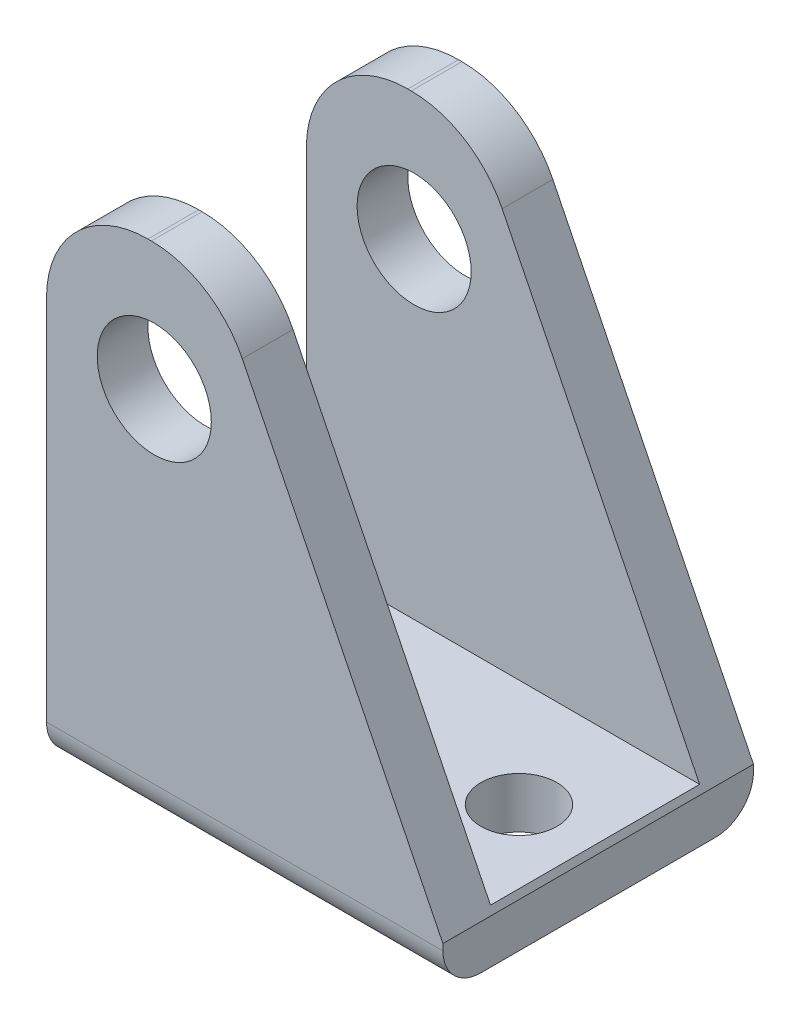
ISO-10303-21;
HEADER;
FILE_DESCRIPTION(('STEP AP214'),'2;1');
FILE_NAME('part.step','',(''),(''),'','','');
FILE_SCHEMA(('AUTOMOTIVE_DESIGN { 1 0 10303 214 1 1 1 1 }'));
ENDSEC;
DATA;
#1=APPLICATION_CONTEXT('core data for automotive mechanical design processes');
#2=APPLICATION_PROTOCOL_DEFINITION('international standard','automotive_design',2000,#1);
#3=PRODUCT_CONTEXT('',#1,'mechanical');
#4=PRODUCT('Part','Part','',(#3));
#5=PRODUCT_RELATED_PRODUCT_CATEGORY('part','',(#4));
#6=PRODUCT_DEFINITION_FORMATION('','',#4);
#7=PRODUCT_DEFINITION_CONTEXT('part definition',#1,'design');
#8=PRODUCT_DEFINITION('design','',#6,#7);
#9=PRODUCT_DEFINITION_SHAPE('','',#8);
#10=(LENGTH_UNIT() NAMED_UNIT(*) SI_UNIT(.MILLI.,.METRE.));
#11=(NAMED_UNIT(*) PLANE_ANGLE_UNIT() SI_UNIT($,.RADIAN.));
#12=(NAMED_UNIT(*) SI_UNIT($,.STERADIAN.) SOLID_ANGLE_UNIT());
#13=UNCERTAINTY_MEASURE_WITH_UNIT(LENGTH_MEASURE(1.E-05),#10,'distance_accuracy_value','');
#14=(GEOMETRIC_REPRESENTATION_CONTEXT(3) GLOBAL_UNCERTAINTY_ASSIGNED_CONTEXT((#13)) GLOBAL_UNIT_ASSIGNED_CONTEXT((#10,
#11,#12)) REPRESENTATION_CONTEXT('',''));
#15=CARTESIAN_POINT('',(0.,0.,0.));
#16=DIRECTION('',(0.,0.,1.));
#17=DIRECTION('',(1.,0.,0.));
#18=AXIS2_PLACEMENT_3D('',#15,#16,#17);
#19=CARTESIAN_POINT('',(0.,40.,24.5));
#20=DIRECTION('',(0.,-1.,0.));
#21=DIRECTION('',(0.,0.,-1.));
#22=AXIS2_PLACEMENT_3D('',#19,#20,#21);
#23=PLANE('',#22);
#24=DIRECTION('',(0.,0.,-1.));
#25=VECTOR('',#24,1.);
#26=CARTESIAN_POINT('',(8.,40.,24.5));
#27=LINE('',#26,#25);
#28=CARTESIAN_POINT('',(8.,40.,0.));
#29=VERTEX_POINT('',#28);
#30=CARTESIAN_POINT('',(8.,40.,4.));
#31=VERTEX_POINT('',#30);
#32=EDGE_CURVE('E239',#29,#31,#27,.F.);
#33=ORIENTED_EDGE('',*,*,#32,.T.);
#34=DIRECTION('',(-1.,0.,0.));
#35=VECTOR('',#34,1.);
#36=CARTESIAN_POINT('',(-1.93555555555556,40.,4.));
#37=LINE('',#36,#35);
#38=CARTESIAN_POINT('',(8.27231625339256,40.,4.));
#39=VERTEX_POINT('',#38);
#40=EDGE_CURVE('E192',#39,#31,#37,.T.);
#41=ORIENTED_EDGE('',*,*,#40,.F.);
#42=DIRECTION('',(0.,0.,-1.));
#43=VECTOR('',#42,1.);
#44=CARTESIAN_POINT('',(8.27231625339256,40.,24.5));
#45=LINE('',#44,#43);
#46=CARTESIAN_POINT('',(8.27231625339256,40.,0.));
#47=VERTEX_POINT('',#46);
#48=EDGE_CURVE('E242',#39,#47,#45,.T.);
#49=ORIENTED_EDGE('',*,*,#48,.T.);
#50=DIRECTION('',(-1.,0.,0.));
#51=VECTOR('',#50,1.);
#52=CARTESIAN_POINT('',(0.,40.,0.));
#53=LINE('',#52,#51);
#54=EDGE_CURVE('E232',#47,#29,#53,.T.);
#55=ORIENTED_EDGE('',*,*,#54,.T.);
#56=EDGE_LOOP('',(#33,#41,#49,#55));
#57=FACE_BOUND('',#56,.T.);
#58=ADVANCED_FACE('F31',(#57),#23,.F.);
#59=CARTESIAN_POINT('',(8.27231625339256,32.,24.5));
#60=DIRECTION('',(0.,0.,-1.));
#61=DIRECTION('',(-1.,0.,0.));
#62=AXIS2_PLACEMENT_3D('',#59,#60,#61);
#63=CYLINDRICAL_SURFACE('',#62,8.);
#64=CARTESIAN_POINT('',(8.27231625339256,32.,4.));
#65=DIRECTION('',(0.,0.,-1.));
#66=DIRECTION('',(-1.,0.,0.));
#67=AXIS2_PLACEMENT_3D('',#64,#65,#66);
#68=CIRCLE('',#67,8.);
#69=CARTESIAN_POINT('',(15.4451235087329,35.5427159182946,4.));
#70=VERTEX_POINT('',#69);
#71=EDGE_CURVE('E207',#70,#39,#68,.F.);
#72=ORIENTED_EDGE('',*,*,#71,.F.);
#73=DIRECTION('',(0.,0.,-1.));
#74=VECTOR('',#73,1.);
#75=CARTESIAN_POINT('',(15.4451235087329,35.5427159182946,24.5));
#76=LINE('',#75,#74);
#77=CARTESIAN_POINT('',(15.4451235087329,35.5427159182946,0.));
#78=VERTEX_POINT('',#77);
#79=EDGE_CURVE('E252',#78,#70,#76,.F.);
#80=ORIENTED_EDGE('',*,*,#79,.F.);
#81=CARTESIAN_POINT('',(8.27231625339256,32.,0.));
#82=DIRECTION('',(0.,0.,-1.));
#83=DIRECTION('',(-1.,0.,0.));
#84=AXIS2_PLACEMENT_3D('',#81,#82,#83);
#85=CIRCLE('',#84,8.);
#86=EDGE_CURVE('E248',#47,#78,#85,.T.);
#87=ORIENTED_EDGE('',*,*,#86,.F.);
#88=ORIENTED_EDGE('',*,*,#48,.F.);
#89=EDGE_LOOP('',(#72,#80,#87,#88));
#90=FACE_BOUND('',#89,.T.);
#91=ADVANCED_FACE('F341',(#90),#63,.T.);
#92=CARTESIAN_POINT('',(8.,32.,24.5));
#93=DIRECTION('',(0.,0.,-1.));
#94=DIRECTION('',(-1.,0.,0.));
#95=AXIS2_PLACEMENT_3D('',#92,#93,#94);
#96=CYLINDRICAL_SURFACE('',#95,8.);
#97=CARTESIAN_POINT('',(8.,32.,4.));
#98=DIRECTION('',(0.,0.,-1.));
#99=DIRECTION('',(-1.,0.,0.));
#100=AXIS2_PLACEMENT_3D('',#97,#98,#99);
#101=CIRCLE('',#100,8.);
#102=CARTESIAN_POINT('',(0.,32.,4.));
#103=VERTEX_POINT('',#102);
#104=EDGE_CURVE('E178',#31,#103,#101,.F.);
#105=ORIENTED_EDGE('',*,*,#104,.F.);
#106=ORIENTED_EDGE('',*,*,#32,.F.);
#107=CARTESIAN_POINT('',(8.,32.,0.));
#108=DIRECTION('',(0.,0.,-1.));
#109=DIRECTION('',(-1.,0.,0.));
#110=AXIS2_PLACEMENT_3D('',#107,#108,#109);
#111=CIRCLE('',#110,8.);
#112=CARTESIAN_POINT('',(0.,32.,0.));
#113=VERTEX_POINT('',#112);
#114=EDGE_CURVE('E246',#113,#29,#111,.T.);
#115=ORIENTED_EDGE('',*,*,#114,.F.);
#116=DIRECTION('',(0.,0.,-1.));
#117=VECTOR('',#116,1.);
#118=CARTESIAN_POINT('',(0.,32.,24.5));
#119=LINE('',#118,#117);
#120=EDGE_CURVE('E161',#103,#113,#119,.T.);
#121=ORIENTED_EDGE('',*,*,#120,.F.);
#122=EDGE_LOOP('',(#105,#106,#115,#121));
#123=FACE_BOUND('',#122,.T.);
#124=ADVANCED_FACE('F267',(#123),#96,.T.);
#125=CARTESIAN_POINT('',(8.5,30.,0.));
#126=DIRECTION('',(0.,0.,1.));
#127=DIRECTION('',(1.,0.,0.));
#128=AXIS2_PLACEMENT_3D('',#125,#126,#127);
#129=CYLINDRICAL_SURFACE('',#128,4.5);
#130=CARTESIAN_POINT('',(8.5,30.,4.));
#131=DIRECTION('',(0.,0.,-1.));
#132=DIRECTION('',(-1.,0.,0.));
#133=AXIS2_PLACEMENT_3D('',#130,#131,#132);
#134=CIRCLE('',#133,4.5);
#135=CARTESIAN_POINT('',(4.,30.,4.));
#136=VERTEX_POINT('',#135);
#137=EDGE_CURVE('E176',#136,#136,#134,.F.);
#138=ORIENTED_EDGE('',*,*,#137,.T.);
#139=EDGE_LOOP('',(#138));
#140=FACE_BOUND('',#139,.T.);
#141=CARTESIAN_POINT('',(8.5,30.,0.));
#142=DIRECTION('',(0.,0.,1.));
#143=DIRECTION('',(1.,0.,0.));
#144=AXIS2_PLACEMENT_3D('',#141,#142,#143);
#145=CIRCLE('',#144,4.5);
#146=CARTESIAN_POINT('',(13.,30.,0.));
#147=VERTEX_POINT('',#146);
#148=EDGE_CURVE('E215',#147,#147,#145,.T.);
#149=ORIENTED_EDGE('',*,*,#148,.F.);
#150=EDGE_LOOP('',(#149));
#151=FACE_BOUND('',#150,.T.);
#152=ADVANCED_FACE('F328',(#140,#151),#129,.F.);
#153=CARTESIAN_POINT('',(33.,0.,24.5));
#154=DIRECTION('',(0.,1.,0.));
#155=DIRECTION('',(-1.,0.,0.));
#156=AXIS2_PLACEMENT_3D('',#153,#154,#155);
#157=PLANE('',#156);
#158=CARTESIAN_POINT('',(25.27,0.,12.5));
#159=DIRECTION('',(0.,1.,0.));
#160=DIRECTION('',(-1.,0.,0.));
#161=AXIS2_PLACEMENT_3D('',#158,#159,#160);
#162=CIRCLE('',#161,2.99999999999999);
#163=CARTESIAN_POINT('',(22.27,0.,12.5));
#164=VERTEX_POINT('',#163);
#165=EDGE_CURVE('E303',#164,#164,#162,.T.);
#166=ORIENTED_EDGE('',*,*,#165,.T.);
#167=EDGE_LOOP('',(#166));
#168=FACE_BOUND('',#167,.T.);
#169=CARTESIAN_POINT('',(5.27,0.,12.5));
#170=DIRECTION('',(0.,1.,0.));
#171=DIRECTION('',(-1.,0.,0.));
#172=AXIS2_PLACEMENT_3D('',#169,#170,#171);
#173=CIRCLE('',#172,3.);
#174=CARTESIAN_POINT('',(2.27,0.,12.5));
#175=VERTEX_POINT('',#174);
#176=EDGE_CURVE('E297',#175,#175,#173,.T.);
#177=ORIENTED_EDGE('',*,*,#176,.T.);
#178=EDGE_LOOP('',(#177));
#179=FACE_BOUND('',#178,.T.);
#180=DIRECTION('',(1.,0.,0.));
#181=VECTOR('',#180,1.);
#182=CARTESIAN_POINT('',(33.,0.,3.));
#183=LINE('',#182,#181);
#184=CARTESIAN_POINT('',(0.,0.,3.));
#185=VERTEX_POINT('',#184);
#186=CARTESIAN_POINT('',(31.2711111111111,0.,3.));
#187=VERTEX_POINT('',#186);
#188=EDGE_CURVE('E150',#185,#187,#183,.T.);
#189=ORIENTED_EDGE('',*,*,#188,.T.);
#190=DIRECTION('',(0.,0.,1.));
#191=VECTOR('',#190,1.);
#192=CARTESIAN_POINT('',(31.2711111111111,0.,24.5));
#193=LINE('',#192,#191);
#194=CARTESIAN_POINT('',(31.2711111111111,0.,21.5));
#195=VERTEX_POINT('',#194);
#196=EDGE_CURVE('E137',#187,#195,#193,.T.);
#197=ORIENTED_EDGE('',*,*,#196,.T.);
#198=DIRECTION('',(1.,0.,0.));
#199=VECTOR('',#198,1.);
#200=CARTESIAN_POINT('',(33.,0.,21.5));
#201=LINE('',#200,#199);
#202=CARTESIAN_POINT('',(0.,0.,21.5));
#203=VERTEX_POINT('',#202);
#204=EDGE_CURVE('E147',#195,#203,#201,.F.);
#205=ORIENTED_EDGE('',*,*,#204,.T.);
#206=DIRECTION('',(0.,0.,-1.));
#207=VECTOR('',#206,1.);
#208=CARTESIAN_POINT('',(0.,0.,24.5));
#209=LINE('',#208,#207);
#210=EDGE_CURVE('E230',#203,#185,#209,.T.);
#211=ORIENTED_EDGE('',*,*,#210,.T.);
#212=EDGE_LOOP('',(#189,#197,#205,#211));
#213=FACE_BOUND('',#212,.T.);
#214=ADVANCED_FACE('F145',(#168,#179,#213),#157,.F.);
#215=CARTESIAN_POINT('',(13.2436296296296,40.,24.5));
#216=DIRECTION('',(-0.896600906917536,-0.44283948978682,0.));
#217=DIRECTION('',(0.44283948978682,-0.896600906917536,0.));
#218=AXIS2_PLACEMENT_3D('',#215,#216,#217);
#219=PLANE('',#218);
#220=DIRECTION('',(-0.44283948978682,0.896600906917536,0.));
#221=VECTOR('',#220,1.);
#222=CARTESIAN_POINT('',(13.2436296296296,40.,24.5));
#223=LINE('',#222,#221);
#224=CARTESIAN_POINT('',(31.2711111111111,3.50041805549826,24.5));
#225=VERTEX_POINT('',#224);
#226=CARTESIAN_POINT('',(15.4451235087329,35.5427159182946,24.5));
#227=VERTEX_POINT('',#226);
#228=EDGE_CURVE('E221',#225,#227,#223,.T.);
#229=ORIENTED_EDGE('',*,*,#228,.F.);
#230=DIRECTION('',(0.,0.,-1.));
#231=VECTOR('',#230,1.);
#232=CARTESIAN_POINT('',(31.2711111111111,3.50041805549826,24.5));
#233=LINE('',#232,#231);
#234=CARTESIAN_POINT('',(31.2711111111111,3.50041805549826,0.));
#235=VERTEX_POINT('',#234);
#236=EDGE_CURVE('E152',#225,#235,#233,.T.);
#237=ORIENTED_EDGE('',*,*,#236,.T.);
#238=DIRECTION('',(-0.44283948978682,0.896600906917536,0.));
#239=VECTOR('',#238,1.);
#240=CARTESIAN_POINT('',(13.2436296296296,40.,0.));
#241=LINE('',#240,#239);
#242=EDGE_CURVE('E218',#235,#78,#241,.T.);
#243=ORIENTED_EDGE('',*,*,#242,.T.);
#244=ORIENTED_EDGE('',*,*,#79,.T.);
#245=DIRECTION('',(0.44283948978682,-0.896600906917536,0.));
#246=VECTOR('',#245,1.);
#247=CARTESIAN_POINT('',(13.2436296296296,40.,4.));
#248=LINE('',#247,#246);
#249=CARTESIAN_POINT('',(31.024362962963,4.,4.));
#250=VERTEX_POINT('',#249);
#251=EDGE_CURVE('E209',#70,#250,#248,.T.);
#252=ORIENTED_EDGE('',*,*,#251,.T.);
#253=DIRECTION('',(0.,0.,-1.));
#254=VECTOR('',#253,1.);
#255=CARTESIAN_POINT('',(31.024362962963,4.,24.5));
#256=LINE('',#255,#254);
#257=CARTESIAN_POINT('',(31.024362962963,4.,20.5));
#258=VERTEX_POINT('',#257);
#259=EDGE_CURVE('E212',#258,#250,#256,.T.);
#260=ORIENTED_EDGE('',*,*,#259,.F.);
#261=DIRECTION('',(-0.44283948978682,0.896600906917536,0.));
#262=VECTOR('',#261,1.);
#263=CARTESIAN_POINT('',(13.2436296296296,40.,20.5));
#264=LINE('',#263,#262);
#265=CARTESIAN_POINT('',(15.4451235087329,35.5427159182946,20.5));
#266=VERTEX_POINT('',#265);
#267=EDGE_CURVE('E179',#258,#266,#264,.T.);
#268=ORIENTED_EDGE('',*,*,#267,.T.);
#269=EDGE_CURVE('E251',#266,#227,#76,.F.);
#270=ORIENTED_EDGE('',*,*,#269,.T.);
#271=EDGE_LOOP('',(#229,#237,#243,#244,#252,#260,#268,#270));
#272=FACE_BOUND('',#271,.T.);
#273=ADVANCED_FACE('F327',(#272),#219,.F.);
#274=CARTESIAN_POINT('',(8.27231625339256,40.,24.5));
#275=VERTEX_POINT('',#274);
#276=CARTESIAN_POINT('',(8.27231625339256,40.,20.5));
#277=VERTEX_POINT('',#276);
#278=EDGE_CURVE('E243',#275,#277,#45,.T.);
#279=ORIENTED_EDGE('',*,*,#278,.T.);
#280=DIRECTION('',(1.,0.,0.));
#281=VECTOR('',#280,1.);
#282=CARTESIAN_POINT('',(-1.93555555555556,40.,20.5));
#283=LINE('',#282,#281);
#284=CARTESIAN_POINT('',(8.,40.,20.5));
#285=VERTEX_POINT('',#284);
#286=EDGE_CURVE('E284',#285,#277,#283,.T.);
#287=ORIENTED_EDGE('',*,*,#286,.F.);
#288=CARTESIAN_POINT('',(8.,40.,24.5));
#289=VERTEX_POINT('',#288);
#290=EDGE_CURVE('E238',#285,#289,#27,.F.);
#291=ORIENTED_EDGE('',*,*,#290,.T.);
#292=DIRECTION('',(-1.,0.,0.));
#293=VECTOR('',#292,1.);
#294=CARTESIAN_POINT('',(0.,40.,24.5));
#295=LINE('',#294,#293);
#296=EDGE_CURVE('E223',#275,#289,#295,.T.);
#297=ORIENTED_EDGE('',*,*,#296,.F.);
#298=EDGE_LOOP('',(#279,#287,#291,#297));
#299=FACE_BOUND('',#298,.T.);
#300=ADVANCED_FACE('F287',(#299),#23,.F.);
#301=CARTESIAN_POINT('',(0.,0.,24.5));
#302=DIRECTION('',(1.,0.,0.));
#303=DIRECTION('',(0.,0.,-1.));
#304=AXIS2_PLACEMENT_3D('',#301,#302,#303);
#305=PLANE('',#304);
#306=DIRECTION('',(0.,0.,1.));
#307=VECTOR('',#306,1.);
#308=CARTESIAN_POINT('',(0.,4.,24.5));
#309=LINE('',#308,#307);
#310=CARTESIAN_POINT('',(0.,4.,4.));
#311=VERTEX_POINT('',#310);
#312=CARTESIAN_POINT('',(0.,4.,20.5));
#313=VERTEX_POINT('',#312);
#314=EDGE_CURVE('E39',#311,#313,#309,.T.);
#315=ORIENTED_EDGE('',*,*,#314,.F.);
#316=DIRECTION('',(0.,1.,0.));
#317=VECTOR('',#316,1.);
#318=CARTESIAN_POINT('',(0.,0.,4.));
#319=LINE('',#318,#317);
#320=EDGE_CURVE('E205',#311,#103,#319,.T.);
#321=ORIENTED_EDGE('',*,*,#320,.T.);
#322=ORIENTED_EDGE('',*,*,#120,.T.);
#323=DIRECTION('',(0.,-1.,0.));
#324=VECTOR('',#323,1.);
#325=CARTESIAN_POINT('',(0.,0.,0.));
#326=LINE('',#325,#324);
#327=CARTESIAN_POINT('',(0.,3.,0.));
#328=VERTEX_POINT('',#327);
#329=EDGE_CURVE('E224',#113,#328,#326,.T.);
#330=ORIENTED_EDGE('',*,*,#329,.T.);
#331=CARTESIAN_POINT('',(0.,3.,3.));
#332=DIRECTION('',(1.,0.,0.));
#333=DIRECTION('',(0.,0.,-1.));
#334=AXIS2_PLACEMENT_3D('',#331,#332,#333);
#335=CIRCLE('',#334,3.);
#336=EDGE_CURVE('E167',#328,#185,#335,.F.);
#337=ORIENTED_EDGE('',*,*,#336,.T.);
#338=ORIENTED_EDGE('',*,*,#210,.F.);
#339=CARTESIAN_POINT('',(0.,3.,21.5));
#340=DIRECTION('',(1.,0.,0.));
#341=DIRECTION('',(0.,0.,-1.));
#342=AXIS2_PLACEMENT_3D('',#339,#340,#341);
#343=CIRCLE('',#342,3.);
#344=CARTESIAN_POINT('',(0.,3.,24.5));
#345=VERTEX_POINT('',#344);
#346=EDGE_CURVE('E155',#203,#345,#343,.F.);
#347=ORIENTED_EDGE('',*,*,#346,.T.);
#348=DIRECTION('',(0.,-1.,0.));
#349=VECTOR('',#348,1.);
#350=CARTESIAN_POINT('',(0.,0.,24.5));
#351=LINE('',#350,#349);
#352=CARTESIAN_POINT('',(0.,32.,24.5));
#353=VERTEX_POINT('',#352);
#354=EDGE_CURVE('E227',#353,#345,#351,.T.);
#355=ORIENTED_EDGE('',*,*,#354,.F.);
#356=CARTESIAN_POINT('',(0.,32.,20.5));
#357=VERTEX_POINT('',#356);
#358=EDGE_CURVE('E156',#353,#357,#119,.T.);
#359=ORIENTED_EDGE('',*,*,#358,.T.);
#360=DIRECTION('',(0.,-1.,0.));
#361=VECTOR('',#360,1.);
#362=CARTESIAN_POINT('',(0.,0.,20.5));
#363=LINE('',#362,#361);
#364=EDGE_CURVE('E53',#357,#313,#363,.T.);
#365=ORIENTED_EDGE('',*,*,#364,.T.);
#366=EDGE_LOOP('',(#315,#321,#322,#330,#337,#338,#347,#355,#359,#365));
#367=FACE_BOUND('',#366,.T.);
#368=ADVANCED_FACE('F194',(#367),#305,.F.);
#369=CARTESIAN_POINT('',(0.,0.,24.5));
#370=DIRECTION('',(0.,0.,-1.));
#371=DIRECTION('',(-1.,0.,0.));
#372=AXIS2_PLACEMENT_3D('',#369,#370,#371);
#373=PLANE('',#372);
#374=CARTESIAN_POINT('',(8.5,30.,24.5));
#375=DIRECTION('',(0.,0.,1.));
#376=DIRECTION('',(1.,0.,0.));
#377=AXIS2_PLACEMENT_3D('',#374,#375,#376);
#378=CIRCLE('',#377,4.5);
#379=CARTESIAN_POINT('',(13.,30.,24.5));
#380=VERTEX_POINT('',#379);
#381=EDGE_CURVE('E214',#380,#380,#378,.T.);
#382=ORIENTED_EDGE('',*,*,#381,.F.);
#383=EDGE_LOOP('',(#382));
#384=FACE_BOUND('',#383,.T.);
#385=DIRECTION('',(1.,0.,0.));
#386=VECTOR('',#385,1.);
#387=CARTESIAN_POINT('',(0.,3.,24.5));
#388=LINE('',#387,#386);
#389=CARTESIAN_POINT('',(31.2711111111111,3.,24.5));
#390=VERTEX_POINT('',#389);
#391=EDGE_CURVE('E169',#345,#390,#388,.T.);
#392=ORIENTED_EDGE('',*,*,#391,.T.);
#393=DIRECTION('',(0.,1.,0.));
#394=VECTOR('',#393,1.);
#395=CARTESIAN_POINT('',(31.2711111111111,0.,24.5));
#396=LINE('',#395,#394);
#397=EDGE_CURVE('E45',#390,#225,#396,.T.);
#398=ORIENTED_EDGE('',*,*,#397,.T.);
#399=ORIENTED_EDGE('',*,*,#228,.T.);
#400=CARTESIAN_POINT('',(8.27231625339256,32.,24.5));
#401=DIRECTION('',(0.,0.,-1.));
#402=DIRECTION('',(-1.,0.,0.));
#403=AXIS2_PLACEMENT_3D('',#400,#401,#402);
#404=CIRCLE('',#403,8.);
#405=EDGE_CURVE('E256',#227,#275,#404,.F.);
#406=ORIENTED_EDGE('',*,*,#405,.T.);
#407=ORIENTED_EDGE('',*,*,#296,.T.);
#408=CARTESIAN_POINT('',(8.,32.,24.5));
#409=DIRECTION('',(0.,0.,-1.));
#410=DIRECTION('',(-1.,0.,0.));
#411=AXIS2_PLACEMENT_3D('',#408,#409,#410);
#412=CIRCLE('',#411,8.);
#413=EDGE_CURVE('E255',#289,#353,#412,.F.);
#414=ORIENTED_EDGE('',*,*,#413,.T.);
#415=ORIENTED_EDGE('',*,*,#354,.T.);
#416=EDGE_LOOP('',(#392,#398,#399,#406,#407,#414,#415));
#417=FACE_BOUND('',#416,.T.);
#418=ADVANCED_FACE('F278',(#384,#417),#373,.F.);
#419=CARTESIAN_POINT('',(0.,0.,0.));
#420=DIRECTION('',(0.,0.,-1.));
#421=DIRECTION('',(-1.,0.,0.));
#422=AXIS2_PLACEMENT_3D('',#419,#420,#421);
#423=PLANE('',#422);
#424=DIRECTION('',(0.,1.,0.));
#425=VECTOR('',#424,1.);
#426=CARTESIAN_POINT('',(31.2711111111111,0.,0.));
#427=LINE('',#426,#425);
#428=CARTESIAN_POINT('',(31.2711111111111,3.,0.));
#429=VERTEX_POINT('',#428);
#430=EDGE_CURVE('E275',#429,#235,#427,.T.);
#431=ORIENTED_EDGE('',*,*,#430,.F.);
#432=DIRECTION('',(1.,0.,0.));
#433=VECTOR('',#432,1.);
#434=CARTESIAN_POINT('',(0.,3.,0.));
#435=LINE('',#434,#433);
#436=EDGE_CURVE('E158',#429,#328,#435,.F.);
#437=ORIENTED_EDGE('',*,*,#436,.T.);
#438=ORIENTED_EDGE('',*,*,#329,.F.);
#439=ORIENTED_EDGE('',*,*,#114,.T.);
#440=ORIENTED_EDGE('',*,*,#54,.F.);
#441=ORIENTED_EDGE('',*,*,#86,.T.);
#442=ORIENTED_EDGE('',*,*,#242,.F.);
#443=EDGE_LOOP('',(#431,#437,#438,#439,#440,#441,#442));
#444=FACE_BOUND('',#443,.T.);
#445=ORIENTED_EDGE('',*,*,#148,.T.);
#446=EDGE_LOOP('',(#445));
#447=FACE_BOUND('',#446,.T.);
#448=ADVANCED_FACE('F271',(#444,#447),#423,.T.);
#449=CARTESIAN_POINT('',(8.27231625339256,32.,20.5));
#450=DIRECTION('',(0.,0.,1.));
#451=DIRECTION('',(1.,0.,0.));
#452=AXIS2_PLACEMENT_3D('',#449,#450,#451);
#453=CIRCLE('',#452,8.);
#454=EDGE_CURVE('E197',#277,#266,#453,.F.);
#455=ORIENTED_EDGE('',*,*,#454,.F.);
#456=ORIENTED_EDGE('',*,*,#278,.F.);
#457=ORIENTED_EDGE('',*,*,#405,.F.);
#458=ORIENTED_EDGE('',*,*,#269,.F.);
#459=EDGE_LOOP('',(#455,#456,#457,#458));
#460=FACE_BOUND('',#459,.T.);
#461=ADVANCED_FACE('F348',(#460),#63,.T.);
#462=CARTESIAN_POINT('',(8.,32.,20.5));
#463=DIRECTION('',(0.,0.,1.));
#464=DIRECTION('',(1.,0.,0.));
#465=AXIS2_PLACEMENT_3D('',#462,#463,#464);
#466=CIRCLE('',#465,8.);
#467=EDGE_CURVE('E174',#357,#285,#466,.F.);
#468=ORIENTED_EDGE('',*,*,#467,.F.);
#469=ORIENTED_EDGE('',*,*,#358,.F.);
#470=ORIENTED_EDGE('',*,*,#413,.F.);
#471=ORIENTED_EDGE('',*,*,#290,.F.);
#472=EDGE_LOOP('',(#468,#469,#470,#471));
#473=FACE_BOUND('',#472,.T.);
#474=ADVANCED_FACE('F282',(#473),#96,.T.);
#475=CARTESIAN_POINT('',(33.,3.,3.));
#476=DIRECTION('',(-1.,0.,0.));
#477=DIRECTION('',(0.,-1.,0.));
#478=AXIS2_PLACEMENT_3D('',#475,#476,#477);
#479=CYLINDRICAL_SURFACE('',#478,3.);
#480=CARTESIAN_POINT('',(31.2711111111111,3.,3.));
#481=DIRECTION('',(-1.,0.,0.));
#482=DIRECTION('',(0.,0.,1.));
#483=AXIS2_PLACEMENT_3D('',#480,#481,#482);
#484=CIRCLE('',#483,3.);
#485=EDGE_CURVE('E151',#187,#429,#484,.F.);
#486=ORIENTED_EDGE('',*,*,#485,.F.);
#487=ORIENTED_EDGE('',*,*,#188,.F.);
#488=ORIENTED_EDGE('',*,*,#336,.F.);
#489=ORIENTED_EDGE('',*,*,#436,.F.);
#490=EDGE_LOOP('',(#486,#487,#488,#489));
#491=FACE_BOUND('',#490,.T.);
#492=ADVANCED_FACE('F277',(#491),#479,.T.);
#493=CARTESIAN_POINT('',(0.,3.,21.5));
#494=DIRECTION('',(1.,0.,0.));
#495=DIRECTION('',(0.,1.,0.));
#496=AXIS2_PLACEMENT_3D('',#493,#494,#495);
#497=CYLINDRICAL_SURFACE('',#496,3.);
#498=CARTESIAN_POINT('',(31.2711111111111,3.,21.5));
#499=DIRECTION('',(-1.,0.,0.));
#500=DIRECTION('',(0.,0.,1.));
#501=AXIS2_PLACEMENT_3D('',#498,#499,#500);
#502=CIRCLE('',#501,3.);
#503=EDGE_CURVE('E11',#390,#195,#502,.F.);
#504=ORIENTED_EDGE('',*,*,#503,.F.);
#505=ORIENTED_EDGE('',*,*,#391,.F.);
#506=ORIENTED_EDGE('',*,*,#346,.F.);
#507=ORIENTED_EDGE('',*,*,#204,.F.);
#508=EDGE_LOOP('',(#504,#505,#506,#507));
#509=FACE_BOUND('',#508,.T.);
#510=ADVANCED_FACE('F33',(#509),#497,.T.);
#511=CARTESIAN_POINT('',(8.5,30.,20.5));
#512=DIRECTION('',(0.,0.,1.));
#513=DIRECTION('',(1.,0.,0.));
#514=AXIS2_PLACEMENT_3D('',#511,#512,#513);
#515=CIRCLE('',#514,4.5);
#516=CARTESIAN_POINT('',(13.,30.,20.5));
#517=VERTEX_POINT('',#516);
#518=EDGE_CURVE('E171',#517,#517,#515,.F.);
#519=ORIENTED_EDGE('',*,*,#518,.T.);
#520=EDGE_LOOP('',(#519));
#521=FACE_BOUND('',#520,.T.);
#522=ORIENTED_EDGE('',*,*,#381,.T.);
#523=EDGE_LOOP('',(#522));
#524=FACE_BOUND('',#523,.T.);
#525=ADVANCED_FACE('F316',(#521,#524),#129,.F.);
#526=CARTESIAN_POINT('',(-1.93555555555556,4.,20.5));
#527=DIRECTION('',(0.,1.,0.));
#528=DIRECTION('',(0.,0.,1.));
#529=AXIS2_PLACEMENT_3D('',#526,#527,#528);
#530=PLANE('',#529);
#531=CARTESIAN_POINT('',(25.27,4.,12.5));
#532=DIRECTION('',(0.,1.,0.));
#533=DIRECTION('',(0.,0.,1.));
#534=AXIS2_PLACEMENT_3D('',#531,#532,#533);
#535=CIRCLE('',#534,2.99999999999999);
#536=CARTESIAN_POINT('',(25.27,4.,15.5));
#537=VERTEX_POINT('',#536);
#538=EDGE_CURVE('E306',#537,#537,#535,.T.);
#539=ORIENTED_EDGE('',*,*,#538,.F.);
#540=EDGE_LOOP('',(#539));
#541=FACE_BOUND('',#540,.T.);
#542=CARTESIAN_POINT('',(5.27,4.,12.5));
#543=DIRECTION('',(0.,1.,0.));
#544=DIRECTION('',(0.,0.,1.));
#545=AXIS2_PLACEMENT_3D('',#542,#543,#544);
#546=CIRCLE('',#545,3.);
#547=CARTESIAN_POINT('',(5.27,4.,15.5));
#548=VERTEX_POINT('',#547);
#549=EDGE_CURVE('E300',#548,#548,#546,.T.);
#550=ORIENTED_EDGE('',*,*,#549,.F.);
#551=EDGE_LOOP('',(#550));
#552=FACE_BOUND('',#551,.T.);
#553=ORIENTED_EDGE('',*,*,#259,.T.);
#554=DIRECTION('',(-1.,0.,0.));
#555=VECTOR('',#554,1.);
#556=CARTESIAN_POINT('',(-1.93555555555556,4.,4.));
#557=LINE('',#556,#555);
#558=EDGE_CURVE('E175',#250,#311,#557,.T.);
#559=ORIENTED_EDGE('',*,*,#558,.T.);
#560=ORIENTED_EDGE('',*,*,#314,.T.);
#561=DIRECTION('',(1.,0.,0.));
#562=VECTOR('',#561,1.);
#563=CARTESIAN_POINT('',(-1.93555555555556,4.,20.5));
#564=LINE('',#563,#562);
#565=EDGE_CURVE('E185',#313,#258,#564,.T.);
#566=ORIENTED_EDGE('',*,*,#565,.T.);
#567=EDGE_LOOP('',(#553,#559,#560,#566));
#568=FACE_BOUND('',#567,.T.);
#569=ADVANCED_FACE('F184',(#541,#552,#568),#530,.T.);
#570=CARTESIAN_POINT('',(-1.93555555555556,4.,4.));
#571=DIRECTION('',(0.,0.,-1.));
#572=DIRECTION('',(-1.,0.,0.));
#573=AXIS2_PLACEMENT_3D('',#570,#571,#572);
#574=PLANE('',#573);
#575=ORIENTED_EDGE('',*,*,#137,.F.);
#576=EDGE_LOOP('',(#575));
#577=FACE_BOUND('',#576,.T.);
#578=ORIENTED_EDGE('',*,*,#71,.T.);
#579=ORIENTED_EDGE('',*,*,#40,.T.);
#580=ORIENTED_EDGE('',*,*,#104,.T.);
#581=ORIENTED_EDGE('',*,*,#320,.F.);
#582=ORIENTED_EDGE('',*,*,#558,.F.);
#583=ORIENTED_EDGE('',*,*,#251,.F.);
#584=EDGE_LOOP('',(#578,#579,#580,#581,#582,#583));
#585=FACE_BOUND('',#584,.T.);
#586=ADVANCED_FACE('F315',(#577,#585),#574,.F.);
#587=CARTESIAN_POINT('',(-1.93555555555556,4.,20.5));
#588=DIRECTION('',(0.,0.,1.));
#589=DIRECTION('',(1.,0.,0.));
#590=AXIS2_PLACEMENT_3D('',#587,#588,#589);
#591=PLANE('',#590);
#592=ORIENTED_EDGE('',*,*,#518,.F.);
#593=EDGE_LOOP('',(#592));
#594=FACE_BOUND('',#593,.T.);
#595=ORIENTED_EDGE('',*,*,#565,.F.);
#596=ORIENTED_EDGE('',*,*,#364,.F.);
#597=ORIENTED_EDGE('',*,*,#467,.T.);
#598=ORIENTED_EDGE('',*,*,#286,.T.);
#599=ORIENTED_EDGE('',*,*,#454,.T.);
#600=ORIENTED_EDGE('',*,*,#267,.F.);
#601=EDGE_LOOP('',(#595,#596,#597,#598,#599,#600));
#602=FACE_BOUND('',#601,.T.);
#603=ADVANCED_FACE('F190',(#594,#602),#591,.F.);
#604=CARTESIAN_POINT('',(31.2711111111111,-32.,-1.08555555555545));
#605=DIRECTION('',(-1.,0.,0.));
#606=DIRECTION('',(0.,0.,1.));
#607=AXIS2_PLACEMENT_3D('',#604,#605,#606);
#608=PLANE('',#607);
#609=ORIENTED_EDGE('',*,*,#430,.T.);
#610=ORIENTED_EDGE('',*,*,#236,.F.);
#611=ORIENTED_EDGE('',*,*,#397,.F.);
#612=ORIENTED_EDGE('',*,*,#503,.T.);
#613=ORIENTED_EDGE('',*,*,#196,.F.);
#614=ORIENTED_EDGE('',*,*,#485,.T.);
#615=EDGE_LOOP('',(#609,#610,#611,#612,#613,#614));
#616=FACE_BOUND('',#615,.T.);
#617=ADVANCED_FACE('F136',(#616),#608,.F.);
#618=CARTESIAN_POINT('',(5.27,-32.,12.5));
#619=DIRECTION('',(0.,1.,0.));
#620=DIRECTION('',(0.,0.,1.));
#621=AXIS2_PLACEMENT_3D('',#618,#619,#620);
#622=CYLINDRICAL_SURFACE('',#621,3.);
#623=ORIENTED_EDGE('',*,*,#549,.T.);
#624=EDGE_LOOP('',(#623));
#625=FACE_BOUND('',#624,.T.);
#626=ORIENTED_EDGE('',*,*,#176,.F.);
#627=EDGE_LOOP('',(#626));
#628=FACE_BOUND('',#627,.T.);
#629=ADVANCED_FACE('F320',(#625,#628),#622,.F.);
#630=CARTESIAN_POINT('',(25.27,-32.,12.5));
#631=DIRECTION('',(0.,1.,0.));
#632=DIRECTION('',(0.,0.,1.));
#633=AXIS2_PLACEMENT_3D('',#630,#631,#632);
#634=CYLINDRICAL_SURFACE('',#633,2.99999999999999);
#635=ORIENTED_EDGE('',*,*,#538,.T.);
#636=EDGE_LOOP('',(#635));
#637=FACE_BOUND('',#636,.T.);
#638=ORIENTED_EDGE('',*,*,#165,.F.);
#639=EDGE_LOOP('',(#638));
#640=FACE_BOUND('',#639,.T.);
#641=ADVANCED_FACE('F310',(#637,#640),#634,.F.);
#642=CLOSED_SHELL('',(#58,#91,#124,#152,#214,#273,#300,#368,#418,#448,#461,#474,#492,#510,#525,
#569,#586,#603,#617,#629,#641));
#643=MANIFOLD_SOLID_BREP('B2',#642);
#644=ADVANCED_BREP_SHAPE_REPRESENTATION('',(#18,#643),#14);
#645=SHAPE_DEFINITION_REPRESENTATION(#9,#644);
ENDSEC;
END-ISO-10303-21;
